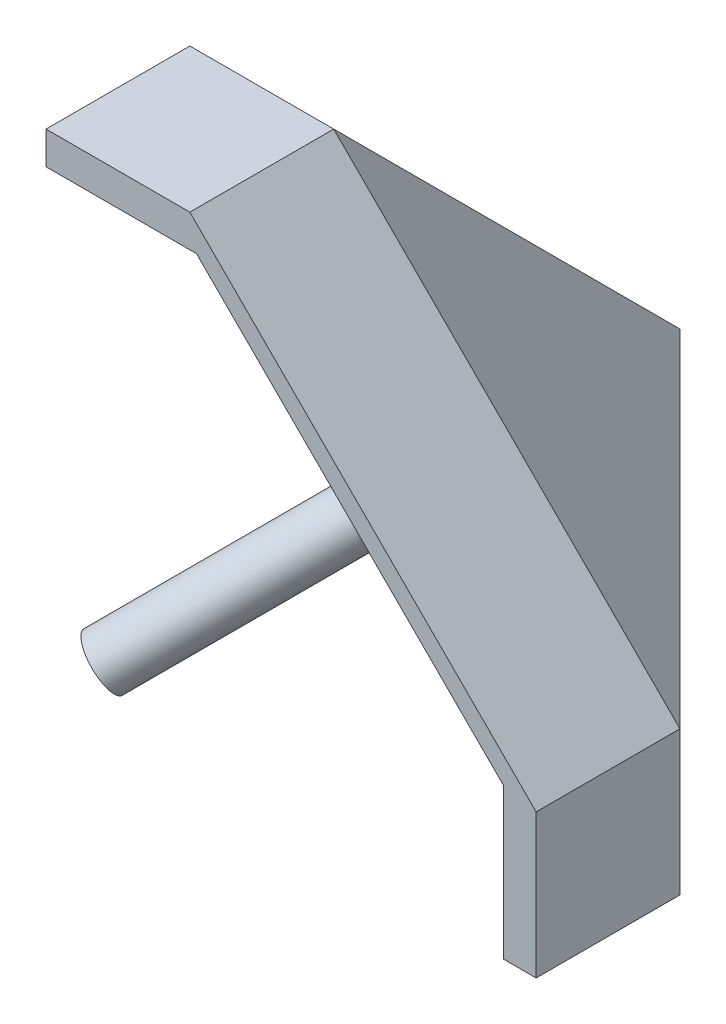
ISO-10303-21;
HEADER;
FILE_DESCRIPTION(('STEP AP214'),'2;1');
FILE_NAME('part.step','',(''),(''),'','','');
FILE_SCHEMA(('AUTOMOTIVE_DESIGN { 1 0 10303 214 1 1 1 1 }'));
ENDSEC;
DATA;
#1=APPLICATION_CONTEXT('core data for automotive mechanical design processes');
#2=APPLICATION_PROTOCOL_DEFINITION('international standard','automotive_design',2000,#1);
#3=PRODUCT_CONTEXT('',#1,'mechanical');
#4=PRODUCT('Part','Part','',(#3));
#5=PRODUCT_RELATED_PRODUCT_CATEGORY('part','',(#4));
#6=PRODUCT_DEFINITION_FORMATION('','',#4);
#7=PRODUCT_DEFINITION_CONTEXT('part definition',#1,'design');
#8=PRODUCT_DEFINITION('design','',#6,#7);
#9=PRODUCT_DEFINITION_SHAPE('','',#8);
#10=(LENGTH_UNIT() NAMED_UNIT(*) SI_UNIT(.MILLI.,.METRE.));
#11=(NAMED_UNIT(*) PLANE_ANGLE_UNIT() SI_UNIT($,.RADIAN.));
#12=(NAMED_UNIT(*) SI_UNIT($,.STERADIAN.) SOLID_ANGLE_UNIT());
#13=UNCERTAINTY_MEASURE_WITH_UNIT(LENGTH_MEASURE(1.E-05),#10,'distance_accuracy_value','');
#14=(GEOMETRIC_REPRESENTATION_CONTEXT(3) GLOBAL_UNCERTAINTY_ASSIGNED_CONTEXT((#13)) GLOBAL_UNIT_ASSIGNED_CONTEXT((#10,
#11,#12)) REPRESENTATION_CONTEXT('',''));
#15=CARTESIAN_POINT('',(0.,0.,0.));
#16=DIRECTION('',(0.,0.,1.));
#17=DIRECTION('',(1.,0.,0.));
#18=AXIS2_PLACEMENT_3D('',#15,#16,#17);
#19=CARTESIAN_POINT('',(-42.3788027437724,2.62119725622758,-2.6211972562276));
#20=DIRECTION('',(0.577350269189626,0.577350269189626,-0.577350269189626));
#21=DIRECTION('',(0.,0.707106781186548,0.707106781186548));
#22=AXIS2_PLACEMENT_3D('',#19,#20,#21);
#23=PLANE('',#22);
#24=CARTESIAN_POINT('',(-42.3788027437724,2.62119725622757,-2.62119725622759));
#25=DIRECTION('',(-0.577350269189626,-0.577350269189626,0.577350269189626));
#26=DIRECTION('',(0.707106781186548,0.,0.707106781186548));
#27=AXIS2_PLACEMENT_3D('',#24,#25,#26);
#28=CIRCLE('',#27,2.5);
#29=CARTESIAN_POINT('',(-40.6110357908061,2.62119725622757,-0.853430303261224));
#30=VERTEX_POINT('',#29);
#31=EDGE_CURVE('E19',#30,#30,#28,.F.);
#32=ORIENTED_EDGE('',*,*,#31,.F.);
#33=EDGE_LOOP('',(#32));
#34=FACE_BOUND('',#33,.T.);
#35=ADVANCED_FACE('F16',(#34),#23,.F.);
#36=CARTESIAN_POINT('',(-22.1715433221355,22.8284566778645,-22.8284566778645));
#37=DIRECTION('',(-0.577350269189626,-0.577350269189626,0.577350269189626));
#38=DIRECTION('',(0.707106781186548,0.,0.707106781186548));
#39=AXIS2_PLACEMENT_3D('',#36,#37,#38);
#40=CYLINDRICAL_SURFACE('',#39,2.5);
#41=CARTESIAN_POINT('',(-22.1715433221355,22.8284566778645,-22.8284566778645));
#42=DIRECTION('',(-0.577350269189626,-0.577350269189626,0.577350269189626));
#43=DIRECTION('',(0.707106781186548,0.,0.707106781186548));
#44=AXIS2_PLACEMENT_3D('',#41,#42,#43);
#45=CIRCLE('',#44,2.5);
#46=CARTESIAN_POINT('',(-20.4037763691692,22.8284566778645,-21.0606897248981));
#47=VERTEX_POINT('',#46);
#48=EDGE_CURVE('E154',#47,#47,#45,.T.);
#49=ORIENTED_EDGE('',*,*,#48,.T.);
#50=EDGE_LOOP('',(#49));
#51=FACE_BOUND('',#50,.T.);
#52=ORIENTED_EDGE('',*,*,#31,.T.);
#53=EDGE_LOOP('',(#52));
#54=FACE_BOUND('',#53,.T.);
#55=ADVANCED_FACE('F168',(#51,#54),#40,.T.);
#56=CARTESIAN_POINT('',(-31.792,23.1802712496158,-31.7688752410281));
#57=DIRECTION('',(1.,0.,0.));
#58=DIRECTION('',(0.,0.,-1.));
#59=AXIS2_PLACEMENT_3D('',#56,#57,#58);
#60=PLANE('',#59);
#61=DIRECTION('',(0.,-0.707106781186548,-0.707106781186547));
#62=VECTOR('',#61,1.);
#63=CARTESIAN_POINT('',(-31.792,13.208,-42.));
#64=LINE('',#63,#62);
#65=CARTESIAN_POINT('',(-31.792,13.208,-42.));
#66=VERTEX_POINT('',#65);
#67=CARTESIAN_POINT('',(-31.792,42.,-13.208));
#68=VERTEX_POINT('',#67);
#69=EDGE_CURVE('E143',#66,#68,#64,.F.);
#70=ORIENTED_EDGE('',*,*,#69,.F.);
#71=DIRECTION('',(0.,0.,1.));
#72=VECTOR('',#71,1.);
#73=CARTESIAN_POINT('',(-31.792,13.208,-28.3887079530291));
#74=LINE('',#73,#72);
#75=CARTESIAN_POINT('',(-31.792,13.208,-42.0693700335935));
#76=VERTEX_POINT('',#75);
#77=EDGE_CURVE('E140',#76,#66,#74,.T.);
#78=ORIENTED_EDGE('',*,*,#77,.F.);
#79=DIRECTION('',(0.,0.707106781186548,0.707106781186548));
#80=VECTOR('',#79,1.);
#81=CARTESIAN_POINT('',(-31.792,27.6386850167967,-27.6386850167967));
#82=LINE('',#81,#80);
#83=CARTESIAN_POINT('',(-31.792,42.0693700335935,-13.208));
#84=VERTEX_POINT('',#83);
#85=EDGE_CURVE('E125',#76,#84,#82,.T.);
#86=ORIENTED_EDGE('',*,*,#85,.T.);
#87=DIRECTION('',(0.,1.,0.));
#88=VECTOR('',#87,1.);
#89=CARTESIAN_POINT('',(-31.792,26.981205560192,-13.208));
#90=LINE('',#89,#88);
#91=EDGE_CURVE('E137',#84,#68,#90,.F.);
#92=ORIENTED_EDGE('',*,*,#91,.T.);
#93=EDGE_LOOP('',(#70,#78,#86,#92));
#94=FACE_BOUND('',#93,.T.);
#95=ADVANCED_FACE('F141',(#94),#60,.T.);
#96=CARTESIAN_POINT('',(-18.0187944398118,26.981205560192,-13.208));
#97=DIRECTION('',(0.,0.,1.));
#98=DIRECTION('',(1.,0.,0.));
#99=AXIS2_PLACEMENT_3D('',#96,#97,#98);
#100=PLANE('',#99);
#101=DIRECTION('',(1.,0.,0.));
#102=VECTOR('',#101,1.);
#103=CARTESIAN_POINT('',(-45.,42.,-13.208));
#104=LINE('',#103,#102);
#105=CARTESIAN_POINT('',(-31.7226299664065,42.,-13.208));
#106=VERTEX_POINT('',#105);
#107=EDGE_CURVE('E400',#68,#106,#104,.T.);
#108=ORIENTED_EDGE('',*,*,#107,.F.);
#109=ORIENTED_EDGE('',*,*,#91,.F.);
#110=DIRECTION('',(0.707106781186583,-0.707106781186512,0.));
#111=VECTOR('',#110,1.);
#112=CARTESIAN_POINT('',(-31.792,42.0693700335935,-13.208));
#113=LINE('',#112,#111);
#114=EDGE_CURVE('E133',#84,#106,#113,.T.);
#115=ORIENTED_EDGE('',*,*,#114,.T.);
#116=EDGE_LOOP('',(#108,#109,#115));
#117=FACE_BOUND('',#116,.T.);
#118=ADVANCED_FACE('F173',(#117),#100,.F.);
#119=CARTESIAN_POINT('',(-22.1715433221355,22.8284566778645,-22.8284566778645));
#120=DIRECTION('',(0.577350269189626,0.577350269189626,-0.577350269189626));
#121=DIRECTION('',(0.,0.707106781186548,0.707106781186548));
#122=AXIS2_PLACEMENT_3D('',#119,#120,#121);
#123=PLANE('',#122);
#124=ORIENTED_EDGE('',*,*,#48,.F.);
#125=EDGE_LOOP('',(#124));
#126=FACE_BOUND('',#125,.T.);
#127=DIRECTION('',(-0.707106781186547,0.707106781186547,0.));
#128=VECTOR('',#127,1.);
#129=CARTESIAN_POINT('',(-2.93062996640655,13.208,-13.208));
#130=LINE('',#129,#128);
#131=CARTESIAN_POINT('',(-2.93062996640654,13.208,-13.208));
#132=VERTEX_POINT('',#131);
#133=CARTESIAN_POINT('',(-3.,13.2773700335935,-13.208));
#134=VERTEX_POINT('',#133);
#135=EDGE_CURVE('E152',#132,#134,#130,.T.);
#136=ORIENTED_EDGE('',*,*,#135,.T.);
#137=DIRECTION('',(0.,0.707106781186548,0.707106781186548));
#138=VECTOR('',#137,1.);
#139=CARTESIAN_POINT('',(-3.,13.2426850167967,-13.2426850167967));
#140=LINE('',#139,#138);
#141=CARTESIAN_POINT('',(-3.,13.8153279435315,-12.6700420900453));
#142=VERTEX_POINT('',#141);
#143=EDGE_CURVE('E158',#142,#134,#140,.F.);
#144=ORIENTED_EDGE('',*,*,#143,.F.);
#145=DIRECTION('',(0.707106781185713,-0.707106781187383,0.));
#146=VECTOR('',#145,1.);
#147=CARTESIAN_POINT('',(-31.1846720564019,42.,-12.6700420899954));
#148=LINE('',#147,#146);
#149=CARTESIAN_POINT('',(-31.1846720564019,42.,-12.6700420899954));
#150=VERTEX_POINT('',#149);
#151=EDGE_CURVE('E397',#150,#142,#148,.T.);
#152=ORIENTED_EDGE('',*,*,#151,.F.);
#153=DIRECTION('',(0.707106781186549,0.,0.707106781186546));
#154=VECTOR('',#153,1.);
#155=CARTESIAN_POINT('',(-31.7226299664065,42.,-13.208));
#156=LINE('',#155,#154);
#157=EDGE_CURVE('E404',#106,#150,#156,.T.);
#158=ORIENTED_EDGE('',*,*,#157,.F.);
#159=ORIENTED_EDGE('',*,*,#114,.F.);
#160=ORIENTED_EDGE('',*,*,#85,.F.);
#161=DIRECTION('',(-0.707106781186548,0.,-0.707106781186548));
#162=VECTOR('',#161,1.);
#163=CARTESIAN_POINT('',(-2.93062996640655,13.208,-13.208));
#164=LINE('',#163,#162);
#165=EDGE_CURVE('E130',#132,#76,#164,.T.);
#166=ORIENTED_EDGE('',*,*,#165,.F.);
#167=EDGE_LOOP('',(#136,#144,#152,#158,#159,#160,#166));
#168=FACE_BOUND('',#167,.T.);
#169=ADVANCED_FACE('F128',(#126,#168),#123,.F.);
#170=CARTESIAN_POINT('',(-18.0187944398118,26.981205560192,-13.208));
#171=DIRECTION('',(0.,0.,1.));
#172=DIRECTION('',(1.,0.,0.));
#173=AXIS2_PLACEMENT_3D('',#170,#171,#172);
#174=PLANE('',#173);
#175=DIRECTION('',(1.,0.,0.));
#176=VECTOR('',#175,1.);
#177=CARTESIAN_POINT('',(-16.6112920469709,13.208,-13.208));
#178=LINE('',#177,#176);
#179=CARTESIAN_POINT('',(-3.00000000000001,13.208,-13.208));
#180=VERTEX_POINT('',#179);
#181=EDGE_CURVE('E148',#180,#132,#178,.T.);
#182=ORIENTED_EDGE('',*,*,#181,.F.);
#183=DIRECTION('',(0.,1.,0.));
#184=VECTOR('',#183,1.);
#185=CARTESIAN_POINT('',(-3.,13.8153279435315,-13.208));
#186=LINE('',#185,#184);
#187=EDGE_CURVE('E390',#134,#180,#186,.F.);
#188=ORIENTED_EDGE('',*,*,#187,.F.);
#189=ORIENTED_EDGE('',*,*,#135,.F.);
#190=EDGE_LOOP('',(#182,#188,#189));
#191=FACE_BOUND('',#190,.T.);
#192=ADVANCED_FACE('F172',(#191),#174,.F.);
#193=CARTESIAN_POINT('',(-16.6112920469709,13.208,-28.3887079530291));
#194=DIRECTION('',(0.,1.,0.));
#195=DIRECTION('',(0.,0.,1.));
#196=AXIS2_PLACEMENT_3D('',#193,#194,#195);
#197=PLANE('',#196);
#198=DIRECTION('',(0.707106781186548,0.,0.707106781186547));
#199=VECTOR('',#198,1.);
#200=CARTESIAN_POINT('',(-3.,13.208,-13.208));
#201=LINE('',#200,#199);
#202=EDGE_CURVE('E384',#180,#66,#201,.F.);
#203=ORIENTED_EDGE('',*,*,#202,.F.);
#204=ORIENTED_EDGE('',*,*,#181,.T.);
#205=ORIENTED_EDGE('',*,*,#165,.T.);
#206=ORIENTED_EDGE('',*,*,#77,.T.);
#207=EDGE_LOOP('',(#203,#204,#205,#206));
#208=FACE_BOUND('',#207,.T.);
#209=ADVANCED_FACE('F151',(#208),#197,.T.);
#210=CARTESIAN_POINT('',(-45.,13.208,-42.));
#211=DIRECTION('',(0.,-0.707106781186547,0.707106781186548));
#212=DIRECTION('',(0.,-0.707106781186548,-0.707106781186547));
#213=AXIS2_PLACEMENT_3D('',#210,#211,#212);
#214=PLANE('',#213);
#215=DIRECTION('',(0.,0.707106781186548,0.707106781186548));
#216=VECTOR('',#215,1.);
#217=CARTESIAN_POINT('',(-45.,13.208,-42.));
#218=LINE('',#217,#216);
#219=CARTESIAN_POINT('',(-45.,13.208,-42.));
#220=VERTEX_POINT('',#219);
#221=CARTESIAN_POINT('',(-45.,42.,-13.208));
#222=VERTEX_POINT('',#221);
#223=EDGE_CURVE('E360',#220,#222,#218,.T.);
#224=ORIENTED_EDGE('',*,*,#223,.F.);
#225=DIRECTION('',(1.,0.,0.));
#226=VECTOR('',#225,1.);
#227=CARTESIAN_POINT('',(-45.,13.208,-42.));
#228=LINE('',#227,#226);
#229=EDGE_CURVE('E362',#66,#220,#228,.F.);
#230=ORIENTED_EDGE('',*,*,#229,.F.);
#231=ORIENTED_EDGE('',*,*,#69,.T.);
#232=DIRECTION('',(1.,0.,0.));
#233=VECTOR('',#232,1.);
#234=CARTESIAN_POINT('',(-45.,42.,-13.208));
#235=LINE('',#234,#233);
#236=EDGE_CURVE('E364',#222,#68,#235,.T.);
#237=ORIENTED_EDGE('',*,*,#236,.F.);
#238=EDGE_LOOP('',(#224,#230,#231,#237));
#239=FACE_BOUND('',#238,.T.);
#240=ADVANCED_FACE('F246',(#239),#214,.T.);
#241=CARTESIAN_POINT('',(-45.,42.,0.));
#242=DIRECTION('',(0.,-1.,0.));
#243=DIRECTION('',(0.,0.,-1.));
#244=AXIS2_PLACEMENT_3D('',#241,#242,#243);
#245=PLANE('',#244);
#246=ORIENTED_EDGE('',*,*,#236,.T.);
#247=ORIENTED_EDGE('',*,*,#107,.T.);
#248=ORIENTED_EDGE('',*,*,#157,.T.);
#249=DIRECTION('',(0.,0.,1.));
#250=VECTOR('',#249,1.);
#251=CARTESIAN_POINT('',(-31.1846720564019,42.,0.));
#252=LINE('',#251,#250);
#253=CARTESIAN_POINT('',(-31.1846720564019,42.,0.));
#254=VERTEX_POINT('',#253);
#255=EDGE_CURVE('E394',#254,#150,#252,.F.);
#256=ORIENTED_EDGE('',*,*,#255,.F.);
#257=DIRECTION('',(1.,0.,0.));
#258=VECTOR('',#257,1.);
#259=CARTESIAN_POINT('',(-18.0187944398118,42.,0.));
#260=LINE('',#259,#258);
#261=CARTESIAN_POINT('',(-45.,42.,0.));
#262=VERTEX_POINT('',#261);
#263=EDGE_CURVE('E411',#262,#254,#260,.T.);
#264=ORIENTED_EDGE('',*,*,#263,.F.);
#265=DIRECTION('',(0.,0.,1.));
#266=VECTOR('',#265,1.);
#267=CARTESIAN_POINT('',(-45.,42.,0.));
#268=LINE('',#267,#266);
#269=EDGE_CURVE('E373',#222,#262,#268,.T.);
#270=ORIENTED_EDGE('',*,*,#269,.F.);
#271=EDGE_LOOP('',(#246,#247,#248,#256,#264,#270));
#272=FACE_BOUND('',#271,.T.);
#273=ADVANCED_FACE('F242',(#272),#245,.T.);
#274=CARTESIAN_POINT('',(-31.1846720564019,42.,0.));
#275=DIRECTION('',(-0.707106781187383,-0.707106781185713,0.));
#276=DIRECTION('',(0.707106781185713,-0.707106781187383,0.));
#277=AXIS2_PLACEMENT_3D('',#274,#275,#276);
#278=PLANE('',#277);
#279=DIRECTION('',(0.707106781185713,-0.707106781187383,0.));
#280=VECTOR('',#279,1.);
#281=CARTESIAN_POINT('',(-31.1846720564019,42.,0.));
#282=LINE('',#281,#280);
#283=CARTESIAN_POINT('',(-3.,13.8153279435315,0.));
#284=VERTEX_POINT('',#283);
#285=EDGE_CURVE('E427',#254,#284,#282,.T.);
#286=ORIENTED_EDGE('',*,*,#285,.F.);
#287=ORIENTED_EDGE('',*,*,#255,.T.);
#288=ORIENTED_EDGE('',*,*,#151,.T.);
#289=DIRECTION('',(0.,0.,1.));
#290=VECTOR('',#289,1.);
#291=CARTESIAN_POINT('',(-3.,13.8153279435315,0.));
#292=LINE('',#291,#290);
#293=EDGE_CURVE('E387',#284,#142,#292,.F.);
#294=ORIENTED_EDGE('',*,*,#293,.F.);
#295=EDGE_LOOP('',(#286,#287,#288,#294));
#296=FACE_BOUND('',#295,.T.);
#297=ADVANCED_FACE('F238',(#296),#278,.T.);
#298=CARTESIAN_POINT('',(-45.,0.,-42.));
#299=DIRECTION('',(0.,0.,1.));
#300=DIRECTION('',(1.,0.,0.));
#301=AXIS2_PLACEMENT_3D('',#298,#299,#300);
#302=PLANE('',#301);
#303=DIRECTION('',(0.,1.,0.));
#304=VECTOR('',#303,1.);
#305=CARTESIAN_POINT('',(-45.,45.,-42.));
#306=LINE('',#305,#304);
#307=CARTESIAN_POINT('',(-45.,0.,-42.));
#308=VERTEX_POINT('',#307);
#309=EDGE_CURVE('E367',#308,#220,#306,.T.);
#310=ORIENTED_EDGE('',*,*,#309,.F.);
#311=DIRECTION('',(1.,0.,0.));
#312=VECTOR('',#311,1.);
#313=CARTESIAN_POINT('',(-45.,0.,-42.));
#314=LINE('',#313,#312);
#315=CARTESIAN_POINT('',(-31.792,0.,-42.));
#316=VERTEX_POINT('',#315);
#317=EDGE_CURVE('E436',#316,#308,#314,.F.);
#318=ORIENTED_EDGE('',*,*,#317,.F.);
#319=DIRECTION('',(0.,1.,0.));
#320=VECTOR('',#319,1.);
#321=CARTESIAN_POINT('',(-31.792,0.,-42.));
#322=LINE('',#321,#320);
#323=EDGE_CURVE('E381',#66,#316,#322,.F.);
#324=ORIENTED_EDGE('',*,*,#323,.F.);
#325=ORIENTED_EDGE('',*,*,#229,.T.);
#326=EDGE_LOOP('',(#310,#318,#324,#325));
#327=FACE_BOUND('',#326,.T.);
#328=ADVANCED_FACE('F234',(#327),#302,.T.);
#329=CARTESIAN_POINT('',(-3.,13.8153279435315,0.));
#330=DIRECTION('',(-1.,0.,0.));
#331=DIRECTION('',(0.,0.,1.));
#332=AXIS2_PLACEMENT_3D('',#329,#330,#331);
#333=PLANE('',#332);
#334=DIRECTION('',(0.,1.,0.));
#335=VECTOR('',#334,1.);
#336=CARTESIAN_POINT('',(-3.,26.981205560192,0.));
#337=LINE('',#336,#335);
#338=CARTESIAN_POINT('',(-3.,0.,0.));
#339=VERTEX_POINT('',#338);
#340=EDGE_CURVE('E430',#284,#339,#337,.F.);
#341=ORIENTED_EDGE('',*,*,#340,.F.);
#342=ORIENTED_EDGE('',*,*,#293,.T.);
#343=ORIENTED_EDGE('',*,*,#143,.T.);
#344=ORIENTED_EDGE('',*,*,#187,.T.);
#345=DIRECTION('',(0.,1.,0.));
#346=VECTOR('',#345,1.);
#347=CARTESIAN_POINT('',(-3.,0.,-13.208));
#348=LINE('',#347,#346);
#349=CARTESIAN_POINT('',(-3.,0.,-13.208));
#350=VERTEX_POINT('',#349);
#351=EDGE_CURVE('E375',#350,#180,#348,.T.);
#352=ORIENTED_EDGE('',*,*,#351,.F.);
#353=DIRECTION('',(0.,0.,-1.));
#354=VECTOR('',#353,1.);
#355=CARTESIAN_POINT('',(-3.,0.,-45.));
#356=LINE('',#355,#354);
#357=EDGE_CURVE('E446',#339,#350,#356,.T.);
#358=ORIENTED_EDGE('',*,*,#357,.F.);
#359=EDGE_LOOP('',(#341,#342,#343,#344,#352,#358));
#360=FACE_BOUND('',#359,.T.);
#361=ADVANCED_FACE('F230',(#360),#333,.T.);
#362=CARTESIAN_POINT('',(-3.,0.,-13.208));
#363=DIRECTION('',(-0.707106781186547,0.,0.707106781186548));
#364=DIRECTION('',(0.707106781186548,0.,0.707106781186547));
#365=AXIS2_PLACEMENT_3D('',#362,#363,#364);
#366=PLANE('',#365);
#367=DIRECTION('',(-0.707106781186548,0.,-0.707106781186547));
#368=VECTOR('',#367,1.);
#369=CARTESIAN_POINT('',(-3.,0.,-13.208));
#370=LINE('',#369,#368);
#371=EDGE_CURVE('E449',#350,#316,#370,.T.);
#372=ORIENTED_EDGE('',*,*,#371,.F.);
#373=ORIENTED_EDGE('',*,*,#351,.T.);
#374=ORIENTED_EDGE('',*,*,#202,.T.);
#375=ORIENTED_EDGE('',*,*,#323,.T.);
#376=EDGE_LOOP('',(#372,#373,#374,#375));
#377=FACE_BOUND('',#376,.T.);
#378=ADVANCED_FACE('F226',(#377),#366,.T.);
#379=CARTESIAN_POINT('',(-45.,45.,0.));
#380=DIRECTION('',(-1.,0.,0.));
#381=DIRECTION('',(0.,0.,1.));
#382=AXIS2_PLACEMENT_3D('',#379,#380,#381);
#383=PLANE('',#382);
#384=ORIENTED_EDGE('',*,*,#309,.T.);
#385=ORIENTED_EDGE('',*,*,#223,.T.);
#386=ORIENTED_EDGE('',*,*,#269,.T.);
#387=DIRECTION('',(0.,1.,0.));
#388=VECTOR('',#387,1.);
#389=CARTESIAN_POINT('',(-45.,26.981205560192,0.));
#390=LINE('',#389,#388);
#391=CARTESIAN_POINT('',(-45.,45.,0.));
#392=VERTEX_POINT('',#391);
#393=EDGE_CURVE('E414',#392,#262,#390,.F.);
#394=ORIENTED_EDGE('',*,*,#393,.F.);
#395=DIRECTION('',(0.,0.,1.));
#396=VECTOR('',#395,1.);
#397=CARTESIAN_POINT('',(-45.,45.,0.));
#398=LINE('',#397,#396);
#399=CARTESIAN_POINT('',(-45.,45.,-13.208));
#400=VERTEX_POINT('',#399);
#401=EDGE_CURVE('E366',#400,#392,#398,.T.);
#402=ORIENTED_EDGE('',*,*,#401,.F.);
#403=DIRECTION('',(0.,0.707106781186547,0.707106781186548));
#404=VECTOR('',#403,1.);
#405=CARTESIAN_POINT('',(-45.,45.,-13.208));
#406=LINE('',#405,#404);
#407=CARTESIAN_POINT('',(-45.,13.208,-45.));
#408=VERTEX_POINT('',#407);
#409=EDGE_CURVE('E460',#408,#400,#406,.T.);
#410=ORIENTED_EDGE('',*,*,#409,.F.);
#411=DIRECTION('',(0.,1.,0.));
#412=VECTOR('',#411,1.);
#413=CARTESIAN_POINT('',(-45.,13.208,-45.));
#414=LINE('',#413,#412);
#415=CARTESIAN_POINT('',(-45.,0.,-45.));
#416=VERTEX_POINT('',#415);
#417=EDGE_CURVE('E455',#416,#408,#414,.T.);
#418=ORIENTED_EDGE('',*,*,#417,.F.);
#419=DIRECTION('',(0.,0.,-1.));
#420=VECTOR('',#419,1.);
#421=CARTESIAN_POINT('',(-45.,0.,-45.));
#422=LINE('',#421,#420);
#423=EDGE_CURVE('E371',#308,#416,#422,.T.);
#424=ORIENTED_EDGE('',*,*,#423,.F.);
#425=EDGE_LOOP('',(#384,#385,#386,#394,#402,#410,#418,#424));
#426=FACE_BOUND('',#425,.T.);
#427=ADVANCED_FACE('F222',(#426),#383,.T.);
#428=CARTESIAN_POINT('',(-31.792,45.,0.));
#429=DIRECTION('',(0.,1.,0.));
#430=DIRECTION('',(0.,0.,1.));
#431=AXIS2_PLACEMENT_3D('',#428,#429,#430);
#432=PLANE('',#431);
#433=DIRECTION('',(1.,0.,0.));
#434=VECTOR('',#433,1.);
#435=CARTESIAN_POINT('',(-18.0187944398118,45.,0.));
#436=LINE('',#435,#434);
#437=CARTESIAN_POINT('',(-31.792,45.,0.));
#438=VERTEX_POINT('',#437);
#439=EDGE_CURVE('E418',#438,#392,#436,.F.);
#440=ORIENTED_EDGE('',*,*,#439,.F.);
#441=DIRECTION('',(0.,0.,1.));
#442=VECTOR('',#441,1.);
#443=CARTESIAN_POINT('',(-31.792,45.,0.));
#444=LINE('',#443,#442);
#445=CARTESIAN_POINT('',(-31.792,45.,-13.208));
#446=VERTEX_POINT('',#445);
#447=EDGE_CURVE('E466',#446,#438,#444,.T.);
#448=ORIENTED_EDGE('',*,*,#447,.F.);
#449=DIRECTION('',(1.,0.,0.));
#450=VECTOR('',#449,1.);
#451=CARTESIAN_POINT('',(-45.,45.,-13.208));
#452=LINE('',#451,#450);
#453=EDGE_CURVE('E463',#400,#446,#452,.T.);
#454=ORIENTED_EDGE('',*,*,#453,.F.);
#455=ORIENTED_EDGE('',*,*,#401,.T.);
#456=EDGE_LOOP('',(#440,#448,#454,#455));
#457=FACE_BOUND('',#456,.T.);
#458=ADVANCED_FACE('F218',(#457),#432,.T.);
#459=CARTESIAN_POINT('',(-18.0187944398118,26.981205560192,0.));
#460=DIRECTION('',(0.,0.,1.));
#461=DIRECTION('',(1.,0.,0.));
#462=AXIS2_PLACEMENT_3D('',#459,#460,#461);
#463=PLANE('',#462);
#464=ORIENTED_EDGE('',*,*,#340,.T.);
#465=DIRECTION('',(1.,0.,0.));
#466=VECTOR('',#465,1.);
#467=CARTESIAN_POINT('',(-45.,0.,0.));
#468=LINE('',#467,#466);
#469=CARTESIAN_POINT('',(0.,0.,0.));
#470=VERTEX_POINT('',#469);
#471=EDGE_CURVE('E443',#470,#339,#468,.F.);
#472=ORIENTED_EDGE('',*,*,#471,.F.);
#473=DIRECTION('',(0.,1.,0.));
#474=VECTOR('',#473,1.);
#475=CARTESIAN_POINT('',(0.,0.,0.));
#476=LINE('',#475,#474);
#477=CARTESIAN_POINT('',(0.,13.208,0.));
#478=VERTEX_POINT('',#477);
#479=EDGE_CURVE('E433',#478,#470,#476,.F.);
#480=ORIENTED_EDGE('',*,*,#479,.F.);
#481=DIRECTION('',(-0.707106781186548,0.707106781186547,0.));
#482=VECTOR('',#481,1.);
#483=CARTESIAN_POINT('',(0.,13.208,0.));
#484=LINE('',#483,#482);
#485=EDGE_CURVE('E422',#438,#478,#484,.F.);
#486=ORIENTED_EDGE('',*,*,#485,.F.);
#487=ORIENTED_EDGE('',*,*,#439,.T.);
#488=ORIENTED_EDGE('',*,*,#393,.T.);
#489=ORIENTED_EDGE('',*,*,#263,.T.);
#490=ORIENTED_EDGE('',*,*,#285,.T.);
#491=EDGE_LOOP('',(#464,#472,#480,#486,#487,#488,#489,#490));
#492=FACE_BOUND('',#491,.T.);
#493=ADVANCED_FACE('F215',(#492),#463,.T.);
#494=CARTESIAN_POINT('',(0.,0.,0.));
#495=DIRECTION('',(1.,0.,0.));
#496=DIRECTION('',(0.,0.,-1.));
#497=AXIS2_PLACEMENT_3D('',#494,#495,#496);
#498=PLANE('',#497);
#499=ORIENTED_EDGE('',*,*,#479,.T.);
#500=DIRECTION('',(0.,0.,-1.));
#501=VECTOR('',#500,1.);
#502=CARTESIAN_POINT('',(0.,0.,-45.));
#503=LINE('',#502,#501);
#504=CARTESIAN_POINT('',(0.,0.,-13.208));
#505=VERTEX_POINT('',#504);
#506=EDGE_CURVE('E439',#505,#470,#503,.F.);
#507=ORIENTED_EDGE('',*,*,#506,.F.);
#508=DIRECTION('',(0.,1.,0.));
#509=VECTOR('',#508,1.);
#510=CARTESIAN_POINT('',(0.,0.,-13.208));
#511=LINE('',#510,#509);
#512=CARTESIAN_POINT('',(0.,13.208,-13.208));
#513=VERTEX_POINT('',#512);
#514=EDGE_CURVE('E34',#513,#505,#511,.F.);
#515=ORIENTED_EDGE('',*,*,#514,.F.);
#516=DIRECTION('',(0.,0.,1.));
#517=VECTOR('',#516,1.);
#518=CARTESIAN_POINT('',(0.,13.208,0.));
#519=LINE('',#518,#517);
#520=EDGE_CURVE('E469',#478,#513,#519,.F.);
#521=ORIENTED_EDGE('',*,*,#520,.F.);
#522=EDGE_LOOP('',(#499,#507,#515,#521));
#523=FACE_BOUND('',#522,.T.);
#524=ADVANCED_FACE('F211',(#523),#498,.T.);
#525=CARTESIAN_POINT('',(-45.,0.,-45.));
#526=DIRECTION('',(0.,-1.,0.));
#527=DIRECTION('',(0.,0.,-1.));
#528=AXIS2_PLACEMENT_3D('',#525,#526,#527);
#529=PLANE('',#528);
#530=ORIENTED_EDGE('',*,*,#357,.T.);
#531=ORIENTED_EDGE('',*,*,#371,.T.);
#532=ORIENTED_EDGE('',*,*,#317,.T.);
#533=ORIENTED_EDGE('',*,*,#423,.T.);
#534=DIRECTION('',(-1.,0.,0.));
#535=VECTOR('',#534,1.);
#536=CARTESIAN_POINT('',(-45.,0.,-45.));
#537=LINE('',#536,#535);
#538=CARTESIAN_POINT('',(-31.792,0.,-45.));
#539=VERTEX_POINT('',#538);
#540=EDGE_CURVE('E452',#539,#416,#537,.T.);
#541=ORIENTED_EDGE('',*,*,#540,.F.);
#542=DIRECTION('',(-0.707106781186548,0.,-0.707106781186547));
#543=VECTOR('',#542,1.);
#544=CARTESIAN_POINT('',(-31.792,0.,-45.));
#545=LINE('',#544,#543);
#546=EDGE_CURVE('E472',#505,#539,#545,.T.);
#547=ORIENTED_EDGE('',*,*,#546,.F.);
#548=ORIENTED_EDGE('',*,*,#506,.T.);
#549=ORIENTED_EDGE('',*,*,#471,.T.);
#550=EDGE_LOOP('',(#530,#531,#532,#533,#541,#547,#548,#549));
#551=FACE_BOUND('',#550,.T.);
#552=ADVANCED_FACE('F207',(#551),#529,.T.);
#553=CARTESIAN_POINT('',(-45.,13.208,-45.));
#554=DIRECTION('',(0.,0.,-1.));
#555=DIRECTION('',(-1.,0.,0.));
#556=AXIS2_PLACEMENT_3D('',#553,#554,#555);
#557=PLANE('',#556);
#558=ORIENTED_EDGE('',*,*,#417,.T.);
#559=DIRECTION('',(1.,0.,0.));
#560=VECTOR('',#559,1.);
#561=CARTESIAN_POINT('',(-45.,13.208,-45.));
#562=LINE('',#561,#560);
#563=CARTESIAN_POINT('',(-31.792,13.208,-45.));
#564=VERTEX_POINT('',#563);
#565=EDGE_CURVE('E457',#564,#408,#562,.F.);
#566=ORIENTED_EDGE('',*,*,#565,.F.);
#567=DIRECTION('',(0.,1.,0.));
#568=VECTOR('',#567,1.);
#569=CARTESIAN_POINT('',(-31.792,0.,-45.));
#570=LINE('',#569,#568);
#571=EDGE_CURVE('E475',#539,#564,#570,.T.);
#572=ORIENTED_EDGE('',*,*,#571,.F.);
#573=ORIENTED_EDGE('',*,*,#540,.T.);
#574=EDGE_LOOP('',(#558,#566,#572,#573));
#575=FACE_BOUND('',#574,.T.);
#576=ADVANCED_FACE('F203',(#575),#557,.T.);
#577=CARTESIAN_POINT('',(-45.,45.,-13.208));
#578=DIRECTION('',(0.,0.707106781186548,-0.707106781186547));
#579=DIRECTION('',(0.,0.707106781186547,0.707106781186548));
#580=AXIS2_PLACEMENT_3D('',#577,#578,#579);
#581=PLANE('',#580);
#582=ORIENTED_EDGE('',*,*,#409,.T.);
#583=ORIENTED_EDGE('',*,*,#453,.T.);
#584=DIRECTION('',(0.,0.707106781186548,0.707106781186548));
#585=VECTOR('',#584,1.);
#586=CARTESIAN_POINT('',(-31.792,29.104,-29.104));
#587=LINE('',#586,#585);
#588=EDGE_CURVE('E478',#564,#446,#587,.T.);
#589=ORIENTED_EDGE('',*,*,#588,.F.);
#590=ORIENTED_EDGE('',*,*,#565,.T.);
#591=EDGE_LOOP('',(#582,#583,#589,#590));
#592=FACE_BOUND('',#591,.T.);
#593=ADVANCED_FACE('F199',(#592),#581,.T.);
#594=CARTESIAN_POINT('',(0.,13.208,0.));
#595=DIRECTION('',(0.707106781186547,0.707106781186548,0.));
#596=DIRECTION('',(-0.707106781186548,0.707106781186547,0.));
#597=AXIS2_PLACEMENT_3D('',#594,#595,#596);
#598=PLANE('',#597);
#599=ORIENTED_EDGE('',*,*,#485,.T.);
#600=ORIENTED_EDGE('',*,*,#520,.T.);
#601=DIRECTION('',(0.707106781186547,-0.707106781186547,0.));
#602=VECTOR('',#601,1.);
#603=CARTESIAN_POINT('',(-31.792,45.,-13.208));
#604=LINE('',#603,#602);
#605=EDGE_CURVE('E25',#446,#513,#604,.T.);
#606=ORIENTED_EDGE('',*,*,#605,.F.);
#607=ORIENTED_EDGE('',*,*,#447,.T.);
#608=EDGE_LOOP('',(#599,#600,#606,#607));
#609=FACE_BOUND('',#608,.T.);
#610=ADVANCED_FACE('F192',(#609),#598,.T.);
#611=CARTESIAN_POINT('',(-31.792,0.,-45.));
#612=DIRECTION('',(0.707106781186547,0.,-0.707106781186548));
#613=DIRECTION('',(-0.707106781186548,0.,-0.707106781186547));
#614=AXIS2_PLACEMENT_3D('',#611,#612,#613);
#615=PLANE('',#614);
#616=ORIENTED_EDGE('',*,*,#546,.T.);
#617=ORIENTED_EDGE('',*,*,#571,.T.);
#618=DIRECTION('',(-0.707106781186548,0.,-0.707106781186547));
#619=VECTOR('',#618,1.);
#620=CARTESIAN_POINT('',(0.,13.208,-13.208));
#621=LINE('',#620,#619);
#622=EDGE_CURVE('E11',#513,#564,#621,.T.);
#623=ORIENTED_EDGE('',*,*,#622,.F.);
#624=ORIENTED_EDGE('',*,*,#514,.T.);
#625=EDGE_LOOP('',(#616,#617,#623,#624));
#626=FACE_BOUND('',#625,.T.);
#627=ADVANCED_FACE('F186',(#626),#615,.T.);
#628=CARTESIAN_POINT('',(-21.1946666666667,23.8053333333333,-23.8053333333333));
#629=DIRECTION('',(0.577350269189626,0.577350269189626,-0.577350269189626));
#630=DIRECTION('',(0.,0.707106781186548,0.707106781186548));
#631=AXIS2_PLACEMENT_3D('',#628,#629,#630);
#632=PLANE('',#631);
#633=ORIENTED_EDGE('',*,*,#605,.T.);
#634=ORIENTED_EDGE('',*,*,#622,.T.);
#635=ORIENTED_EDGE('',*,*,#588,.T.);
#636=EDGE_LOOP('',(#633,#634,#635));
#637=FACE_BOUND('',#636,.T.);
#638=ADVANCED_FACE('F184',(#637),#632,.T.);
#639=CLOSED_SHELL('',(#35,#55,#95,#118,#169,#192,#209,#240,#273,#297,#328,#361,#378,#427,#458,
#493,#524,#552,#576,#593,#610,#627,#638));
#640=MANIFOLD_SOLID_BREP('B1',#639);
#641=ADVANCED_BREP_SHAPE_REPRESENTATION('',(#18,#640),#14);
#642=SHAPE_DEFINITION_REPRESENTATION(#9,#641);
ENDSEC;
END-ISO-10303-21;
